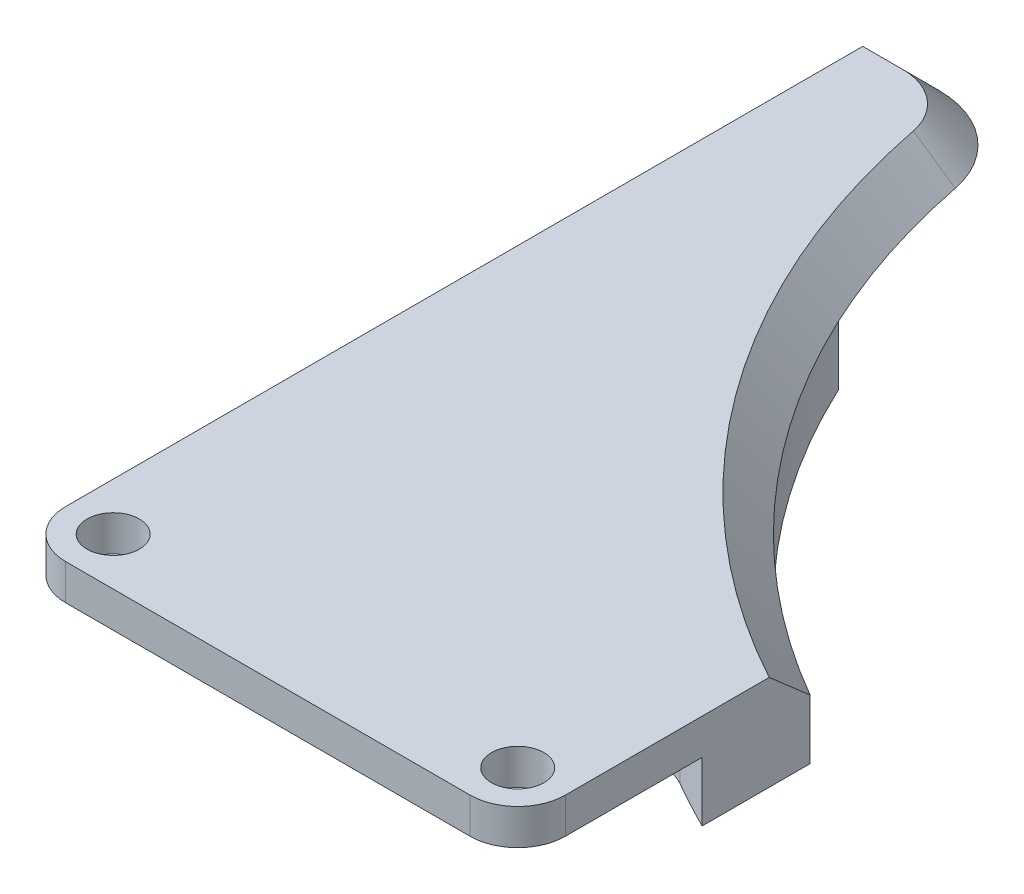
ISO-10303-21;
HEADER;
FILE_DESCRIPTION(('STEP AP214'),'2;1');
FILE_NAME('part.step','',(''),(''),'','','');
FILE_SCHEMA(('AUTOMOTIVE_DESIGN { 1 0 10303 214 1 1 1 1 }'));
ENDSEC;
DATA;
#1=APPLICATION_CONTEXT('core data for automotive mechanical design processes');
#2=APPLICATION_PROTOCOL_DEFINITION('international standard','automotive_design',2000,#1);
#3=PRODUCT_CONTEXT('',#1,'mechanical');
#4=PRODUCT('Part','Part','',(#3));
#5=PRODUCT_RELATED_PRODUCT_CATEGORY('part','',(#4));
#6=PRODUCT_DEFINITION_FORMATION('','',#4);
#7=PRODUCT_DEFINITION_CONTEXT('part definition',#1,'design');
#8=PRODUCT_DEFINITION('design','',#6,#7);
#9=PRODUCT_DEFINITION_SHAPE('','',#8);
#10=(LENGTH_UNIT() NAMED_UNIT(*) SI_UNIT(.MILLI.,.METRE.));
#11=(NAMED_UNIT(*) PLANE_ANGLE_UNIT() SI_UNIT($,.RADIAN.));
#12=(NAMED_UNIT(*) SI_UNIT($,.STERADIAN.) SOLID_ANGLE_UNIT());
#13=UNCERTAINTY_MEASURE_WITH_UNIT(LENGTH_MEASURE(1.E-05),#10,'distance_accuracy_value','');
#14=(GEOMETRIC_REPRESENTATION_CONTEXT(3) GLOBAL_UNCERTAINTY_ASSIGNED_CONTEXT((#13)) GLOBAL_UNIT_ASSIGNED_CONTEXT((#10,
#11,#12)) REPRESENTATION_CONTEXT('',''));
#15=CARTESIAN_POINT('',(0.,0.,0.));
#16=DIRECTION('',(0.,0.,1.));
#17=DIRECTION('',(1.,0.,0.));
#18=AXIS2_PLACEMENT_3D('',#15,#16,#17);
#19=CARTESIAN_POINT('',(0.,4.,-22.));
#20=DIRECTION('',(1.,0.,0.));
#21=DIRECTION('',(0.,0.,-1.));
#22=AXIS2_PLACEMENT_3D('',#19,#20,#21);
#23=PLANE('',#22);
#24=DIRECTION('',(0.,0.,-1.));
#25=VECTOR('',#24,1.);
#26=CARTESIAN_POINT('',(0.,2.5,0.));
#27=LINE('',#26,#25);
#28=CARTESIAN_POINT('',(0.,2.5,-2.));
#29=VERTEX_POINT('',#28);
#30=CARTESIAN_POINT('',(0.,2.5,-37.));
#31=VERTEX_POINT('',#30);
#32=EDGE_CURVE('E224',#29,#31,#27,.T.);
#33=ORIENTED_EDGE('',*,*,#32,.F.);
#34=DIRECTION('',(0.,-1.,0.));
#35=VECTOR('',#34,1.);
#36=CARTESIAN_POINT('',(0.,4.,-2.));
#37=LINE('',#36,#35);
#38=CARTESIAN_POINT('',(0.,4.,-2.));
#39=VERTEX_POINT('',#38);
#40=EDGE_CURVE('E11',#29,#39,#37,.F.);
#41=ORIENTED_EDGE('',*,*,#40,.T.);
#42=DIRECTION('',(0.,0.,1.));
#43=VECTOR('',#42,1.);
#44=CARTESIAN_POINT('',(0.,4.,-22.));
#45=LINE('',#44,#43);
#46=CARTESIAN_POINT('',(0.,4.,-35.5));
#47=VERTEX_POINT('',#46);
#48=EDGE_CURVE('E249',#47,#39,#45,.T.);
#49=ORIENTED_EDGE('',*,*,#48,.F.);
#50=DIRECTION('',(0.,0.70710678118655,0.707106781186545));
#51=VECTOR('',#50,1.);
#52=CARTESIAN_POINT('',(0.,4.,-35.5));
#53=LINE('',#52,#51);
#54=EDGE_CURVE('E372',#47,#31,#53,.F.);
#55=ORIENTED_EDGE('',*,*,#54,.T.);
#56=EDGE_LOOP('',(#33,#41,#49,#55));
#57=FACE_BOUND('',#56,.T.);
#58=ADVANCED_FACE('F36',(#57),#23,.F.);
#59=CARTESIAN_POINT('',(0.,4.,0.));
#60=DIRECTION('',(0.,0.,-1.));
#61=DIRECTION('',(-1.,0.,0.));
#62=AXIS2_PLACEMENT_3D('',#59,#60,#61);
#63=PLANE('',#62);
#64=DIRECTION('',(-1.,0.,0.));
#65=VECTOR('',#64,1.);
#66=CARTESIAN_POINT('',(0.,2.5,0.));
#67=LINE('',#66,#65);
#68=CARTESIAN_POINT('',(19.,2.5,0.));
#69=VERTEX_POINT('',#68);
#70=CARTESIAN_POINT('',(2.,2.5,0.));
#71=VERTEX_POINT('',#70);
#72=EDGE_CURVE('E221',#69,#71,#67,.T.);
#73=ORIENTED_EDGE('',*,*,#72,.F.);
#74=DIRECTION('',(0.,-1.,0.));
#75=VECTOR('',#74,1.);
#76=CARTESIAN_POINT('',(19.,4.,0.));
#77=LINE('',#76,#75);
#78=CARTESIAN_POINT('',(19.,4.,0.));
#79=VERTEX_POINT('',#78);
#80=EDGE_CURVE('E57',#69,#79,#77,.F.);
#81=ORIENTED_EDGE('',*,*,#80,.T.);
#82=DIRECTION('',(1.,0.,0.));
#83=VECTOR('',#82,1.);
#84=CARTESIAN_POINT('',(0.,4.,0.));
#85=LINE('',#84,#83);
#86=CARTESIAN_POINT('',(2.,4.,0.));
#87=VERTEX_POINT('',#86);
#88=EDGE_CURVE('E251',#87,#79,#85,.T.);
#89=ORIENTED_EDGE('',*,*,#88,.F.);
#90=DIRECTION('',(0.,-1.,0.));
#91=VECTOR('',#90,1.);
#92=CARTESIAN_POINT('',(2.,4.,0.));
#93=LINE('',#92,#91);
#94=EDGE_CURVE('E392',#87,#71,#93,.T.);
#95=ORIENTED_EDGE('',*,*,#94,.T.);
#96=EDGE_LOOP('',(#73,#81,#89,#95));
#97=FACE_BOUND('',#96,.T.);
#98=ADVANCED_FACE('F309',(#97),#63,.F.);
#99=CARTESIAN_POINT('',(21.,4.,0.));
#100=DIRECTION('',(-1.,0.,0.));
#101=DIRECTION('',(0.,0.,1.));
#102=AXIS2_PLACEMENT_3D('',#99,#100,#101);
#103=PLANE('',#102);
#104=DIRECTION('',(0.,0.,-1.));
#105=VECTOR('',#104,1.);
#106=CARTESIAN_POINT('',(21.,4.,0.));
#107=LINE('',#106,#105);
#108=CARTESIAN_POINT('',(21.,4.,-2.));
#109=VERTEX_POINT('',#108);
#110=CARTESIAN_POINT('',(21.,4.,-10.5678746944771));
#111=VERTEX_POINT('',#110);
#112=EDGE_CURVE('E253',#109,#111,#107,.T.);
#113=ORIENTED_EDGE('',*,*,#112,.F.);
#114=DIRECTION('',(0.,-1.,0.));
#115=VECTOR('',#114,1.);
#116=CARTESIAN_POINT('',(21.,4.,-2.00000000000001));
#117=LINE('',#116,#115);
#118=CARTESIAN_POINT('',(21.,2.5,-2.00000000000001));
#119=VERTEX_POINT('',#118);
#120=EDGE_CURVE('E376',#109,#119,#117,.T.);
#121=ORIENTED_EDGE('',*,*,#120,.T.);
#122=DIRECTION('',(0.,0.,1.));
#123=VECTOR('',#122,1.);
#124=CARTESIAN_POINT('',(21.,2.5,0.));
#125=LINE('',#124,#123);
#126=CARTESIAN_POINT('',(21.,2.5,-7.75096900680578));
#127=VERTEX_POINT('',#126);
#128=EDGE_CURVE('E217',#127,#119,#125,.T.);
#129=ORIENTED_EDGE('',*,*,#128,.F.);
#130=DIRECTION('',(0.,-1.,0.));
#131=VECTOR('',#130,1.);
#132=CARTESIAN_POINT('',(21.,2.5,-7.75096900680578));
#133=LINE('',#132,#131);
#134=CARTESIAN_POINT('',(21.,0.,-7.75096900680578));
#135=VERTEX_POINT('',#134);
#136=EDGE_CURVE('E234',#127,#135,#133,.T.);
#137=ORIENTED_EDGE('',*,*,#136,.T.);
#138=DIRECTION('',(0.,0.,-1.));
#139=VECTOR('',#138,1.);
#140=CARTESIAN_POINT('',(21.,0.,0.));
#141=LINE('',#140,#139);
#142=CARTESIAN_POINT('',(21.,0.,-12.2871870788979));
#143=VERTEX_POINT('',#142);
#144=EDGE_CURVE('E246',#135,#143,#141,.T.);
#145=ORIENTED_EDGE('',*,*,#144,.T.);
#146=DIRECTION('',(0.,1.,0.));
#147=VECTOR('',#146,1.);
#148=CARTESIAN_POINT('',(21.,0.,-12.2871870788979));
#149=LINE('',#148,#147);
#150=CARTESIAN_POINT('',(21.,2.5,-12.2871870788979));
#151=VERTEX_POINT('',#150);
#152=EDGE_CURVE('E172',#143,#151,#149,.T.);
#153=ORIENTED_EDGE('',*,*,#152,.T.);
#154=CARTESIAN_POINT('',(21.,2.5,-12.2871870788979));
#155=CARTESIAN_POINT('',(21.,2.74897993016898,-11.999745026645));
#156=CARTESIAN_POINT('',(21.,2.9984699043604,-11.7127479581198));
#157=CARTESIAN_POINT('',(21.,3.49846990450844,-11.1396438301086));
#158=CARTESIAN_POINT('',(21.,3.74897993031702,-10.8535367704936));
#159=CARTESIAN_POINT('',(21.,4.,-10.5678746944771));
#160=B_SPLINE_CURVE_WITH_KNOTS('',3,(#154,#155,#156,#157,#158,#159),.UNSPECIFIED.,.F.,.F.,(4,2,
4),(0.,1.14083876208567,2.28167735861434),.UNSPECIFIED.);
#161=EDGE_CURVE('E290',#151,#111,#160,.T.);
#162=ORIENTED_EDGE('',*,*,#161,.T.);
#163=EDGE_LOOP('',(#113,#121,#129,#137,#145,#153,#162));
#164=FACE_BOUND('',#163,.T.);
#165=ADVANCED_FACE('F304',(#164),#103,.F.);
#166=CARTESIAN_POINT('',(0.,0.,0.));
#167=DIRECTION('',(0.,1.,0.));
#168=DIRECTION('',(0.,0.,1.));
#169=AXIS2_PLACEMENT_3D('',#166,#167,#168);
#170=PLANE('',#169);
#171=DIRECTION('',(0.,0.,-1.));
#172=VECTOR('',#171,1.);
#173=CARTESIAN_POINT('',(16.,0.,0.));
#174=LINE('',#173,#172);
#175=CARTESIAN_POINT('',(16.,0.,-7.));
#176=VERTEX_POINT('',#175);
#177=CARTESIAN_POINT('',(16.,0.,-7.09103465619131));
#178=VERTEX_POINT('',#177);
#179=EDGE_CURVE('E218',#176,#178,#174,.T.);
#180=ORIENTED_EDGE('',*,*,#179,.F.);
#181=CARTESIAN_POINT('',(14.,0.,-7.));
#182=DIRECTION('',(0.,1.,0.));
#183=DIRECTION('',(0.,0.,1.));
#184=AXIS2_PLACEMENT_3D('',#181,#182,#183);
#185=CIRCLE('',#184,2.);
#186=CARTESIAN_POINT('',(14.,0.,-5.));
#187=VERTEX_POINT('',#186);
#188=EDGE_CURVE('E273',#176,#187,#185,.F.);
#189=ORIENTED_EDGE('',*,*,#188,.T.);
#190=DIRECTION('',(1.,0.,0.));
#191=VECTOR('',#190,1.);
#192=CARTESIAN_POINT('',(0.,0.,-5.));
#193=LINE('',#192,#191);
#194=CARTESIAN_POINT('',(6.,0.,-5.));
#195=VERTEX_POINT('',#194);
#196=EDGE_CURVE('E240',#195,#187,#193,.T.);
#197=ORIENTED_EDGE('',*,*,#196,.F.);
#198=CARTESIAN_POINT('',(6.,0.,-7.));
#199=DIRECTION('',(0.,1.,0.));
#200=DIRECTION('',(0.,0.,1.));
#201=AXIS2_PLACEMENT_3D('',#198,#199,#200);
#202=CIRCLE('',#201,2.);
#203=CARTESIAN_POINT('',(4.,0.,-7.));
#204=VERTEX_POINT('',#203);
#205=EDGE_CURVE('E271',#195,#204,#202,.F.);
#206=ORIENTED_EDGE('',*,*,#205,.T.);
#207=DIRECTION('',(0.,0.,1.));
#208=VECTOR('',#207,1.);
#209=CARTESIAN_POINT('',(4.,0.,0.));
#210=LINE('',#209,#208);
#211=CARTESIAN_POINT('',(4.,0.,-22.));
#212=VERTEX_POINT('',#211);
#213=EDGE_CURVE('E237',#212,#204,#210,.T.);
#214=ORIENTED_EDGE('',*,*,#213,.F.);
#215=DIRECTION('',(-1.,0.,0.));
#216=VECTOR('',#215,1.);
#217=CARTESIAN_POINT('',(8.,0.,-22.));
#218=LINE('',#217,#216);
#219=CARTESIAN_POINT('',(8.,0.,-22.));
#220=VERTEX_POINT('',#219);
#221=EDGE_CURVE('E185',#220,#212,#218,.T.);
#222=ORIENTED_EDGE('',*,*,#221,.F.);
#223=DIRECTION('',(0.,0.,1.));
#224=VECTOR('',#223,1.);
#225=CARTESIAN_POINT('',(8.,0.,0.));
#226=LINE('',#225,#224);
#227=CARTESIAN_POINT('',(8.,0.,-26.4722507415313));
#228=VERTEX_POINT('',#227);
#229=EDGE_CURVE('E177',#228,#220,#226,.T.);
#230=ORIENTED_EDGE('',*,*,#229,.F.);
#231=CARTESIAN_POINT('',(37.,0.,-40.));
#232=DIRECTION('',(0.,1.,0.));
#233=DIRECTION('',(0.,0.,1.));
#234=AXIS2_PLACEMENT_3D('',#231,#232,#233);
#235=CIRCLE('',#234,32.);
#236=EDGE_CURVE('E166',#228,#143,#235,.T.);
#237=ORIENTED_EDGE('',*,*,#236,.T.);
#238=ORIENTED_EDGE('',*,*,#144,.F.);
#239=CARTESIAN_POINT('',(37.,0.,-40.));
#240=DIRECTION('',(0.,-1.,0.));
#241=DIRECTION('',(0.,0.,-1.));
#242=AXIS2_PLACEMENT_3D('',#239,#240,#241);
#243=CIRCLE('',#242,36.);
#244=CARTESIAN_POINT('',(19.,0.,-8.82308546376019));
#245=VERTEX_POINT('',#244);
#246=EDGE_CURVE('E212',#135,#245,#243,.T.);
#247=ORIENTED_EDGE('',*,*,#246,.T.);
#248=CARTESIAN_POINT('',(18.,0.,-7.09103465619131));
#249=DIRECTION('',(0.,1.,0.));
#250=DIRECTION('',(0.,0.,1.));
#251=AXIS2_PLACEMENT_3D('',#248,#249,#250);
#252=CIRCLE('',#251,2.);
#253=EDGE_CURVE('E208',#245,#178,#252,.T.);
#254=ORIENTED_EDGE('',*,*,#253,.T.);
#255=EDGE_LOOP('',(#180,#189,#197,#206,#214,#222,#230,#237,#238,#247,#254));
#256=FACE_BOUND('',#255,.T.);
#257=ADVANCED_FACE('F182',(#256),#170,.F.);
#258=CARTESIAN_POINT('',(8.,4.,-22.));
#259=DIRECTION('',(0.,0.,1.));
#260=DIRECTION('',(1.,0.,0.));
#261=AXIS2_PLACEMENT_3D('',#258,#259,#260);
#262=PLANE('',#261);
#263=DIRECTION('',(0.,-1.,0.));
#264=VECTOR('',#263,1.);
#265=CARTESIAN_POINT('',(4.,2.5,-22.));
#266=LINE('',#265,#264);
#267=CARTESIAN_POINT('',(4.,2.5,-22.));
#268=VERTEX_POINT('',#267);
#269=EDGE_CURVE('E244',#268,#212,#266,.T.);
#270=ORIENTED_EDGE('',*,*,#269,.F.);
#271=DIRECTION('',(1.,0.,0.));
#272=VECTOR('',#271,1.);
#273=CARTESIAN_POINT('',(0.,2.5,-22.));
#274=LINE('',#273,#272);
#275=CARTESIAN_POINT('',(8.,2.5,-22.));
#276=VERTEX_POINT('',#275);
#277=EDGE_CURVE('E204',#268,#276,#274,.T.);
#278=ORIENTED_EDGE('',*,*,#277,.T.);
#279=DIRECTION('',(0.,-1.,0.));
#280=VECTOR('',#279,1.);
#281=CARTESIAN_POINT('',(8.,4.,-22.));
#282=LINE('',#281,#280);
#283=EDGE_CURVE('E255',#276,#220,#282,.T.);
#284=ORIENTED_EDGE('',*,*,#283,.T.);
#285=ORIENTED_EDGE('',*,*,#221,.T.);
#286=EDGE_LOOP('',(#270,#278,#284,#285));
#287=FACE_BOUND('',#286,.T.);
#288=ADVANCED_FACE('F311',(#287),#262,.F.);
#289=CARTESIAN_POINT('',(0.,4.,0.));
#290=DIRECTION('',(0.,1.,0.));
#291=DIRECTION('',(0.,0.,1.));
#292=AXIS2_PLACEMENT_3D('',#289,#290,#291);
#293=PLANE('',#292);
#294=CARTESIAN_POINT('',(19.,4.,-2.));
#295=DIRECTION('',(0.,1.,0.));
#296=DIRECTION('',(0.,0.,1.));
#297=AXIS2_PLACEMENT_3D('',#294,#295,#296);
#298=CIRCLE('',#297,1.1);
#299=CARTESIAN_POINT('',(19.,4.,-0.900000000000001));
#300=VERTEX_POINT('',#299);
#301=EDGE_CURVE('E386',#300,#300,#298,.T.);
#302=ORIENTED_EDGE('',*,*,#301,.F.);
#303=EDGE_LOOP('',(#302));
#304=FACE_BOUND('',#303,.T.);
#305=CARTESIAN_POINT('',(2.,4.,-2.));
#306=DIRECTION('',(0.,1.,0.));
#307=DIRECTION('',(0.,0.,1.));
#308=AXIS2_PLACEMENT_3D('',#305,#306,#307);
#309=CIRCLE('',#308,1.1);
#310=CARTESIAN_POINT('',(2.,4.,-0.900000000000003));
#311=VERTEX_POINT('',#310);
#312=EDGE_CURVE('E198',#311,#311,#309,.T.);
#313=ORIENTED_EDGE('',*,*,#312,.F.);
#314=EDGE_LOOP('',(#313));
#315=FACE_BOUND('',#314,.T.);
#316=ORIENTED_EDGE('',*,*,#88,.T.);
#317=CARTESIAN_POINT('',(19.,4.,-2.00000000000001));
#318=DIRECTION('',(0.,1.,0.));
#319=DIRECTION('',(0.,0.,1.));
#320=AXIS2_PLACEMENT_3D('',#317,#318,#319);
#321=CIRCLE('',#320,2.);
#322=EDGE_CURVE('E44',#79,#109,#321,.T.);
#323=ORIENTED_EDGE('',*,*,#322,.T.);
#324=ORIENTED_EDGE('',*,*,#112,.T.);
#325=CARTESIAN_POINT('',(37.,4.,-40.));
#326=DIRECTION('',(0.,1.,0.));
#327=DIRECTION('',(0.,0.,1.));
#328=AXIS2_PLACEMENT_3D('',#325,#326,#327);
#329=CIRCLE('',#328,33.5);
#330=CARTESIAN_POINT('',(4.13939666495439,4.,-33.4861111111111));
#331=VERTEX_POINT('',#330);
#332=EDGE_CURVE('E369',#111,#331,#329,.F.);
#333=ORIENTED_EDGE('',*,*,#332,.T.);
#334=CARTESIAN_POINT('',(1.68711283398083,4.,-33.));
#335=DIRECTION('',(0.,1.,0.));
#336=DIRECTION('',(0.,0.,1.));
#337=AXIS2_PLACEMENT_3D('',#334,#335,#336);
#338=CIRCLE('',#337,2.50000000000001);
#339=CARTESIAN_POINT('',(1.68711283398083,4.,-35.5));
#340=VERTEX_POINT('',#339);
#341=EDGE_CURVE('E373',#331,#340,#338,.T.);
#342=ORIENTED_EDGE('',*,*,#341,.T.);
#343=DIRECTION('',(-1.,0.,0.));
#344=VECTOR('',#343,1.);
#345=CARTESIAN_POINT('',(0.,4.,-35.5));
#346=LINE('',#345,#344);
#347=EDGE_CURVE('E298',#340,#47,#346,.T.);
#348=ORIENTED_EDGE('',*,*,#347,.T.);
#349=ORIENTED_EDGE('',*,*,#48,.T.);
#350=CARTESIAN_POINT('',(2.,4.,-2.));
#351=DIRECTION('',(0.,1.,0.));
#352=DIRECTION('',(0.,0.,1.));
#353=AXIS2_PLACEMENT_3D('',#350,#351,#352);
#354=CIRCLE('',#353,2.);
#355=EDGE_CURVE('E396',#39,#87,#354,.T.);
#356=ORIENTED_EDGE('',*,*,#355,.T.);
#357=EDGE_LOOP('',(#316,#323,#324,#333,#342,#348,#349,#356));
#358=FACE_BOUND('',#357,.T.);
#359=ADVANCED_FACE('F398',(#304,#315,#358),#293,.T.);
#360=CARTESIAN_POINT('',(37.,2.5,-40.));
#361=DIRECTION('',(0.,-1.,0.));
#362=DIRECTION('',(0.,0.,-1.));
#363=AXIS2_PLACEMENT_3D('',#360,#361,#362);
#364=CYLINDRICAL_SURFACE('',#363,36.);
#365=CARTESIAN_POINT('',(37.,2.5,-40.));
#366=DIRECTION('',(0.,-1.,0.));
#367=DIRECTION('',(0.,0.,-1.));
#368=AXIS2_PLACEMENT_3D('',#365,#366,#367);
#369=CIRCLE('',#368,36.);
#370=CARTESIAN_POINT('',(19.,2.5,-8.82308546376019));
#371=VERTEX_POINT('',#370);
#372=EDGE_CURVE('E214',#127,#371,#369,.T.);
#373=ORIENTED_EDGE('',*,*,#372,.T.);
#374=DIRECTION('',(0.,-1.,0.));
#375=VECTOR('',#374,1.);
#376=CARTESIAN_POINT('',(19.,2.5,-8.82308546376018));
#377=LINE('',#376,#375);
#378=EDGE_CURVE('E259',#371,#245,#377,.T.);
#379=ORIENTED_EDGE('',*,*,#378,.T.);
#380=ORIENTED_EDGE('',*,*,#246,.F.);
#381=ORIENTED_EDGE('',*,*,#136,.F.);
#382=EDGE_LOOP('',(#373,#379,#380,#381));
#383=FACE_BOUND('',#382,.T.);
#384=ADVANCED_FACE('F354',(#383),#364,.T.);
#385=CARTESIAN_POINT('',(16.,2.5,0.));
#386=DIRECTION('',(-1.,0.,0.));
#387=DIRECTION('',(0.,0.,1.));
#388=AXIS2_PLACEMENT_3D('',#385,#386,#387);
#389=PLANE('',#388);
#390=DIRECTION('',(0.,0.,-1.));
#391=VECTOR('',#390,1.);
#392=CARTESIAN_POINT('',(16.,2.5,0.));
#393=LINE('',#392,#391);
#394=CARTESIAN_POINT('',(16.,2.5,-7.));
#395=VERTEX_POINT('',#394);
#396=CARTESIAN_POINT('',(16.,2.5,-7.09103465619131));
#397=VERTEX_POINT('',#396);
#398=EDGE_CURVE('E232',#395,#397,#393,.T.);
#399=ORIENTED_EDGE('',*,*,#398,.F.);
#400=DIRECTION('',(0.,-1.,0.));
#401=VECTOR('',#400,1.);
#402=CARTESIAN_POINT('',(16.,2.5,-7.));
#403=LINE('',#402,#401);
#404=EDGE_CURVE('E207',#395,#176,#403,.T.);
#405=ORIENTED_EDGE('',*,*,#404,.T.);
#406=ORIENTED_EDGE('',*,*,#179,.T.);
#407=DIRECTION('',(0.,-1.,0.));
#408=VECTOR('',#407,1.);
#409=CARTESIAN_POINT('',(16.,2.5,-7.09103465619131));
#410=LINE('',#409,#408);
#411=EDGE_CURVE('E262',#178,#397,#410,.F.);
#412=ORIENTED_EDGE('',*,*,#411,.T.);
#413=EDGE_LOOP('',(#399,#405,#406,#412));
#414=FACE_BOUND('',#413,.T.);
#415=ADVANCED_FACE('F347',(#414),#389,.F.);
#416=CARTESIAN_POINT('',(0.,2.5,-5.));
#417=DIRECTION('',(0.,0.,-1.));
#418=DIRECTION('',(-1.,0.,0.));
#419=AXIS2_PLACEMENT_3D('',#416,#417,#418);
#420=PLANE('',#419);
#421=ORIENTED_EDGE('',*,*,#196,.T.);
#422=DIRECTION('',(0.,-1.,0.));
#423=VECTOR('',#422,1.);
#424=CARTESIAN_POINT('',(14.,2.5,-5.));
#425=LINE('',#424,#423);
#426=CARTESIAN_POINT('',(14.,2.5,-5.));
#427=VERTEX_POINT('',#426);
#428=EDGE_CURVE('E278',#187,#427,#425,.F.);
#429=ORIENTED_EDGE('',*,*,#428,.T.);
#430=DIRECTION('',(1.,0.,0.));
#431=VECTOR('',#430,1.);
#432=CARTESIAN_POINT('',(0.,2.5,-5.));
#433=LINE('',#432,#431);
#434=CARTESIAN_POINT('',(6.,2.5,-5.));
#435=VERTEX_POINT('',#434);
#436=EDGE_CURVE('E229',#435,#427,#433,.T.);
#437=ORIENTED_EDGE('',*,*,#436,.F.);
#438=DIRECTION('',(0.,-1.,0.));
#439=VECTOR('',#438,1.);
#440=CARTESIAN_POINT('',(6.,2.5,-5.));
#441=LINE('',#440,#439);
#442=EDGE_CURVE('E275',#435,#195,#441,.T.);
#443=ORIENTED_EDGE('',*,*,#442,.T.);
#444=EDGE_LOOP('',(#421,#429,#437,#443));
#445=FACE_BOUND('',#444,.T.);
#446=ADVANCED_FACE('F341',(#445),#420,.F.);
#447=CARTESIAN_POINT('',(4.,2.5,0.));
#448=DIRECTION('',(1.,0.,0.));
#449=DIRECTION('',(0.,0.,-1.));
#450=AXIS2_PLACEMENT_3D('',#447,#448,#449);
#451=PLANE('',#450);
#452=ORIENTED_EDGE('',*,*,#213,.T.);
#453=DIRECTION('',(0.,-1.,0.));
#454=VECTOR('',#453,1.);
#455=CARTESIAN_POINT('',(4.,2.5,-7.));
#456=LINE('',#455,#454);
#457=CARTESIAN_POINT('',(4.,2.5,-7.));
#458=VERTEX_POINT('',#457);
#459=EDGE_CURVE('E280',#204,#458,#456,.F.);
#460=ORIENTED_EDGE('',*,*,#459,.T.);
#461=DIRECTION('',(0.,0.,1.));
#462=VECTOR('',#461,1.);
#463=CARTESIAN_POINT('',(4.,2.5,0.));
#464=LINE('',#463,#462);
#465=EDGE_CURVE('E226',#268,#458,#464,.T.);
#466=ORIENTED_EDGE('',*,*,#465,.F.);
#467=ORIENTED_EDGE('',*,*,#269,.T.);
#468=EDGE_LOOP('',(#452,#460,#466,#467));
#469=FACE_BOUND('',#468,.T.);
#470=ADVANCED_FACE('F358',(#469),#451,.F.);
#471=CARTESIAN_POINT('',(0.,2.5,0.));
#472=DIRECTION('',(0.,-1.,0.));
#473=DIRECTION('',(0.,0.,-1.));
#474=AXIS2_PLACEMENT_3D('',#471,#472,#473);
#475=PLANE('',#474);
#476=CARTESIAN_POINT('',(19.,2.5,-2.));
#477=DIRECTION('',(0.,-1.,0.));
#478=DIRECTION('',(0.,0.,-1.));
#479=AXIS2_PLACEMENT_3D('',#476,#477,#478);
#480=CIRCLE('',#479,1.1);
#481=CARTESIAN_POINT('',(19.,2.5,-3.1));
#482=VERTEX_POINT('',#481);
#483=EDGE_CURVE('E383',#482,#482,#480,.T.);
#484=ORIENTED_EDGE('',*,*,#483,.F.);
#485=EDGE_LOOP('',(#484));
#486=FACE_BOUND('',#485,.T.);
#487=CARTESIAN_POINT('',(2.,2.5,-2.));
#488=DIRECTION('',(0.,-1.,0.));
#489=DIRECTION('',(0.,0.,-1.));
#490=AXIS2_PLACEMENT_3D('',#487,#488,#489);
#491=CIRCLE('',#490,1.1);
#492=CARTESIAN_POINT('',(2.,2.5,-3.1));
#493=VERTEX_POINT('',#492);
#494=EDGE_CURVE('E379',#493,#493,#491,.T.);
#495=ORIENTED_EDGE('',*,*,#494,.F.);
#496=EDGE_LOOP('',(#495));
#497=FACE_BOUND('',#496,.T.);
#498=ORIENTED_EDGE('',*,*,#128,.T.);
#499=CARTESIAN_POINT('',(19.,2.5,-2.00000000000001));
#500=DIRECTION('',(0.,-1.,0.));
#501=DIRECTION('',(0.,0.,-1.));
#502=AXIS2_PLACEMENT_3D('',#499,#500,#501);
#503=CIRCLE('',#502,2.);
#504=EDGE_CURVE('E390',#119,#69,#503,.T.);
#505=ORIENTED_EDGE('',*,*,#504,.T.);
#506=ORIENTED_EDGE('',*,*,#72,.T.);
#507=CARTESIAN_POINT('',(2.,2.5,-2.));
#508=DIRECTION('',(0.,-1.,0.));
#509=DIRECTION('',(0.,0.,-1.));
#510=AXIS2_PLACEMENT_3D('',#507,#508,#509);
#511=CIRCLE('',#510,2.);
#512=EDGE_CURVE('E388',#71,#29,#511,.T.);
#513=ORIENTED_EDGE('',*,*,#512,.T.);
#514=ORIENTED_EDGE('',*,*,#32,.T.);
#515=DIRECTION('',(-1.,0.,0.));
#516=VECTOR('',#515,1.);
#517=CARTESIAN_POINT('',(0.,2.5,-37.));
#518=LINE('',#517,#516);
#519=CARTESIAN_POINT('',(1.68711283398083,2.5,-37.));
#520=VERTEX_POINT('',#519);
#521=EDGE_CURVE('E209',#520,#31,#518,.T.);
#522=ORIENTED_EDGE('',*,*,#521,.F.);
#523=CARTESIAN_POINT('',(1.68711283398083,2.5,-33.));
#524=DIRECTION('',(0.,-1.,0.));
#525=DIRECTION('',(0.,0.,-1.));
#526=AXIS2_PLACEMENT_3D('',#523,#524,#525);
#527=CIRCLE('',#526,4.);
#528=CARTESIAN_POINT('',(5.61076696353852,2.5,-33.7777777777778));
#529=VERTEX_POINT('',#528);
#530=EDGE_CURVE('E286',#520,#529,#527,.T.);
#531=ORIENTED_EDGE('',*,*,#530,.T.);
#532=CARTESIAN_POINT('',(37.,2.5,-40.));
#533=DIRECTION('',(0.,-1.,0.));
#534=DIRECTION('',(0.,0.,-1.));
#535=AXIS2_PLACEMENT_3D('',#532,#533,#534);
#536=CIRCLE('',#535,32.);
#537=CARTESIAN_POINT('',(8.,2.5,-26.4722507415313));
#538=VERTEX_POINT('',#537);
#539=EDGE_CURVE('E176',#538,#529,#536,.T.);
#540=ORIENTED_EDGE('',*,*,#539,.F.);
#541=DIRECTION('',(0.,0.,-1.));
#542=VECTOR('',#541,1.);
#543=CARTESIAN_POINT('',(8.,2.5,-22.));
#544=LINE('',#543,#542);
#545=EDGE_CURVE('E191',#276,#538,#544,.T.);
#546=ORIENTED_EDGE('',*,*,#545,.F.);
#547=ORIENTED_EDGE('',*,*,#277,.F.);
#548=ORIENTED_EDGE('',*,*,#465,.T.);
#549=CARTESIAN_POINT('',(6.,2.5,-7.));
#550=DIRECTION('',(0.,-1.,0.));
#551=DIRECTION('',(0.,0.,-1.));
#552=AXIS2_PLACEMENT_3D('',#549,#550,#551);
#553=CIRCLE('',#552,2.);
#554=EDGE_CURVE('E284',#458,#435,#553,.F.);
#555=ORIENTED_EDGE('',*,*,#554,.T.);
#556=ORIENTED_EDGE('',*,*,#436,.T.);
#557=CARTESIAN_POINT('',(14.,2.5,-7.));
#558=DIRECTION('',(0.,-1.,0.));
#559=DIRECTION('',(0.,0.,-1.));
#560=AXIS2_PLACEMENT_3D('',#557,#558,#559);
#561=CIRCLE('',#560,2.);
#562=EDGE_CURVE('E282',#427,#395,#561,.F.);
#563=ORIENTED_EDGE('',*,*,#562,.T.);
#564=ORIENTED_EDGE('',*,*,#398,.T.);
#565=CARTESIAN_POINT('',(18.,2.5,-7.09103465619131));
#566=DIRECTION('',(0.,-1.,0.));
#567=DIRECTION('',(0.,0.,-1.));
#568=AXIS2_PLACEMENT_3D('',#565,#566,#567);
#569=CIRCLE('',#568,2.);
#570=EDGE_CURVE('E265',#397,#371,#569,.T.);
#571=ORIENTED_EDGE('',*,*,#570,.T.);
#572=ORIENTED_EDGE('',*,*,#372,.F.);
#573=EDGE_LOOP('',(#498,#505,#506,#513,#514,#522,#531,#540,#546,#547,#548,#555,#556,#563,#564,
#571,#572));
#574=FACE_BOUND('',#573,.T.);
#575=ADVANCED_FACE('F320',(#486,#497,#574),#475,.T.);
#576=CARTESIAN_POINT('',(18.,2.5,-7.09103465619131));
#577=DIRECTION('',(0.,-1.,0.));
#578=DIRECTION('',(0.,0.,-1.));
#579=AXIS2_PLACEMENT_3D('',#576,#577,#578);
#580=CYLINDRICAL_SURFACE('',#579,2.);
#581=ORIENTED_EDGE('',*,*,#570,.F.);
#582=ORIENTED_EDGE('',*,*,#411,.F.);
#583=ORIENTED_EDGE('',*,*,#253,.F.);
#584=ORIENTED_EDGE('',*,*,#378,.F.);
#585=EDGE_LOOP('',(#581,#582,#583,#584));
#586=FACE_BOUND('',#585,.T.);
#587=ADVANCED_FACE('F317',(#586),#580,.F.);
#588=CARTESIAN_POINT('',(37.,0.,-40.));
#589=DIRECTION('',(0.,1.,0.));
#590=DIRECTION('',(0.,0.,1.));
#591=AXIS2_PLACEMENT_3D('',#588,#589,#590);
#592=CYLINDRICAL_SURFACE('',#591,32.);
#593=DIRECTION('',(0.,1.,0.));
#594=VECTOR('',#593,1.);
#595=CARTESIAN_POINT('',(8.,-17.5048260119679,-26.4722507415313));
#596=LINE('',#595,#594);
#597=EDGE_CURVE('E170',#228,#538,#596,.T.);
#598=ORIENTED_EDGE('',*,*,#597,.T.);
#599=CARTESIAN_POINT('',(37.,2.5,-40.));
#600=DIRECTION('',(0.,1.,0.));
#601=DIRECTION('',(0.,0.,1.));
#602=AXIS2_PLACEMENT_3D('',#599,#600,#601);
#603=CIRCLE('',#602,32.);
#604=EDGE_CURVE('E288',#538,#151,#603,.T.);
#605=ORIENTED_EDGE('',*,*,#604,.T.);
#606=ORIENTED_EDGE('',*,*,#152,.F.);
#607=ORIENTED_EDGE('',*,*,#236,.F.);
#608=EDGE_LOOP('',(#598,#605,#606,#607));
#609=FACE_BOUND('',#608,.T.);
#610=ADVANCED_FACE('F168',(#609),#592,.F.);
#611=CARTESIAN_POINT('',(14.,2.5,-7.));
#612=DIRECTION('',(0.,-1.,0.));
#613=DIRECTION('',(0.,0.,-1.));
#614=AXIS2_PLACEMENT_3D('',#611,#612,#613);
#615=CYLINDRICAL_SURFACE('',#614,2.);
#616=ORIENTED_EDGE('',*,*,#562,.F.);
#617=ORIENTED_EDGE('',*,*,#428,.F.);
#618=ORIENTED_EDGE('',*,*,#188,.F.);
#619=ORIENTED_EDGE('',*,*,#404,.F.);
#620=EDGE_LOOP('',(#616,#617,#618,#619));
#621=FACE_BOUND('',#620,.T.);
#622=ADVANCED_FACE('F322',(#621),#615,.T.);
#623=CARTESIAN_POINT('',(6.,2.5,-7.));
#624=DIRECTION('',(0.,-1.,0.));
#625=DIRECTION('',(0.,0.,-1.));
#626=AXIS2_PLACEMENT_3D('',#623,#624,#625);
#627=CYLINDRICAL_SURFACE('',#626,2.);
#628=ORIENTED_EDGE('',*,*,#554,.F.);
#629=ORIENTED_EDGE('',*,*,#459,.F.);
#630=ORIENTED_EDGE('',*,*,#205,.F.);
#631=ORIENTED_EDGE('',*,*,#442,.F.);
#632=EDGE_LOOP('',(#628,#629,#630,#631));
#633=FACE_BOUND('',#632,.T.);
#634=ADVANCED_FACE('F324',(#633),#627,.T.);
#635=CARTESIAN_POINT('',(8.,-17.5048260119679,0.));
#636=DIRECTION('',(1.,0.,0.));
#637=DIRECTION('',(0.,0.,-1.));
#638=AXIS2_PLACEMENT_3D('',#635,#636,#637);
#639=PLANE('',#638);
#640=ORIENTED_EDGE('',*,*,#229,.T.);
#641=ORIENTED_EDGE('',*,*,#283,.F.);
#642=ORIENTED_EDGE('',*,*,#545,.T.);
#643=ORIENTED_EDGE('',*,*,#597,.F.);
#644=EDGE_LOOP('',(#640,#641,#642,#643));
#645=FACE_BOUND('',#644,.T.);
#646=ADVANCED_FACE('F190',(#645),#639,.F.);
#647=CARTESIAN_POINT('',(0.,4.,-35.5));
#648=DIRECTION('',(0.,-0.707106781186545,0.70710678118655));
#649=DIRECTION('',(-1.,0.,0.));
#650=AXIS2_PLACEMENT_3D('',#647,#648,#649);
#651=PLANE('',#650);
#652=ORIENTED_EDGE('',*,*,#54,.F.);
#653=ORIENTED_EDGE('',*,*,#347,.F.);
#654=DIRECTION('',(0.,0.70710678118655,0.707106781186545));
#655=VECTOR('',#654,1.);
#656=CARTESIAN_POINT('',(1.68711283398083,2.5,-37.));
#657=LINE('',#656,#655);
#658=EDGE_CURVE('E192',#520,#340,#657,.T.);
#659=ORIENTED_EDGE('',*,*,#658,.F.);
#660=ORIENTED_EDGE('',*,*,#521,.T.);
#661=EDGE_LOOP('',(#652,#653,#659,#660));
#662=FACE_BOUND('',#661,.T.);
#663=ADVANCED_FACE('F331',(#662),#651,.F.);
#664=CARTESIAN_POINT('',(1.68711283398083,4.,-33.));
#665=DIRECTION('',(0.,-1.,0.));
#666=DIRECTION('',(0.,0.,-1.));
#667=AXIS2_PLACEMENT_3D('',#664,#665,#666);
#668=CONICAL_SURFACE('',#667,2.50000000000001,0.785398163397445);
#669=ORIENTED_EDGE('',*,*,#658,.T.);
#670=ORIENTED_EDGE('',*,*,#341,.F.);
#671=DIRECTION('',(-0.693610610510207,0.707106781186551,0.137492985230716));
#672=VECTOR('',#671,1.);
#673=CARTESIAN_POINT('',(5.61076696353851,2.5,-33.7777777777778));
#674=LINE('',#673,#672);
#675=EDGE_CURVE('E195',#529,#331,#674,.T.);
#676=ORIENTED_EDGE('',*,*,#675,.F.);
#677=ORIENTED_EDGE('',*,*,#530,.F.);
#678=EDGE_LOOP('',(#669,#670,#676,#677));
#679=FACE_BOUND('',#678,.T.);
#680=ADVANCED_FACE('F409',(#679),#668,.T.);
#681=CARTESIAN_POINT('',(37.,2.5,-40.));
#682=DIRECTION('',(0.,1.,0.));
#683=DIRECTION('',(0.,0.,1.));
#684=AXIS2_PLACEMENT_3D('',#681,#682,#683);
#685=CONICAL_SURFACE('',#684,32.,0.785398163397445);
#686=ORIENTED_EDGE('',*,*,#675,.T.);
#687=ORIENTED_EDGE('',*,*,#332,.F.);
#688=ORIENTED_EDGE('',*,*,#161,.F.);
#689=ORIENTED_EDGE('',*,*,#604,.F.);
#690=ORIENTED_EDGE('',*,*,#539,.T.);
#691=EDGE_LOOP('',(#686,#687,#688,#689,#690));
#692=FACE_BOUND('',#691,.T.);
#693=ADVANCED_FACE('F300',(#692),#685,.F.);
#694=CARTESIAN_POINT('',(2.,0.,-2.));
#695=DIRECTION('',(0.,1.,0.));
#696=DIRECTION('',(0.,0.,1.));
#697=AXIS2_PLACEMENT_3D('',#694,#695,#696);
#698=CYLINDRICAL_SURFACE('',#697,1.1);
#699=ORIENTED_EDGE('',*,*,#494,.T.);
#700=EDGE_LOOP('',(#699));
#701=FACE_BOUND('',#700,.T.);
#702=ORIENTED_EDGE('',*,*,#312,.T.);
#703=EDGE_LOOP('',(#702));
#704=FACE_BOUND('',#703,.T.);
#705=ADVANCED_FACE('F415',(#701,#704),#698,.F.);
#706=CARTESIAN_POINT('',(19.,0.,-2.));
#707=DIRECTION('',(0.,1.,0.));
#708=DIRECTION('',(0.,0.,1.));
#709=AXIS2_PLACEMENT_3D('',#706,#707,#708);
#710=CYLINDRICAL_SURFACE('',#709,1.1);
#711=ORIENTED_EDGE('',*,*,#483,.T.);
#712=EDGE_LOOP('',(#711));
#713=FACE_BOUND('',#712,.T.);
#714=ORIENTED_EDGE('',*,*,#301,.T.);
#715=EDGE_LOOP('',(#714));
#716=FACE_BOUND('',#715,.T.);
#717=ADVANCED_FACE('F418',(#713,#716),#710,.F.);
#718=CARTESIAN_POINT('',(19.,4.,-2.00000000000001));
#719=DIRECTION('',(0.,-1.,0.));
#720=DIRECTION('',(0.,0.,-1.));
#721=AXIS2_PLACEMENT_3D('',#718,#719,#720);
#722=CYLINDRICAL_SURFACE('',#721,2.);
#723=ORIENTED_EDGE('',*,*,#322,.F.);
#724=ORIENTED_EDGE('',*,*,#80,.F.);
#725=ORIENTED_EDGE('',*,*,#504,.F.);
#726=ORIENTED_EDGE('',*,*,#120,.F.);
#727=EDGE_LOOP('',(#723,#724,#725,#726));
#728=FACE_BOUND('',#727,.T.);
#729=ADVANCED_FACE('F400',(#728),#722,.T.);
#730=CARTESIAN_POINT('',(2.,4.,-2.));
#731=DIRECTION('',(0.,-1.,0.));
#732=DIRECTION('',(0.,0.,-1.));
#733=AXIS2_PLACEMENT_3D('',#730,#731,#732);
#734=CYLINDRICAL_SURFACE('',#733,2.);
#735=ORIENTED_EDGE('',*,*,#355,.F.);
#736=ORIENTED_EDGE('',*,*,#40,.F.);
#737=ORIENTED_EDGE('',*,*,#512,.F.);
#738=ORIENTED_EDGE('',*,*,#94,.F.);
#739=EDGE_LOOP('',(#735,#736,#737,#738));
#740=FACE_BOUND('',#739,.T.);
#741=ADVANCED_FACE('F38',(#740),#734,.T.);
#742=CLOSED_SHELL('',(#58,#98,#165,#257,#288,#359,#384,#415,#446,#470,#575,#587,#610,#622,#634,
#646,#663,#680,#693,#705,#717,#729,#741));
#743=MANIFOLD_SOLID_BREP('B2',#742);
#744=ADVANCED_BREP_SHAPE_REPRESENTATION('',(#18,#743),#14);
#745=SHAPE_DEFINITION_REPRESENTATION(#9,#744);
ENDSEC;
END-ISO-10303-21;
